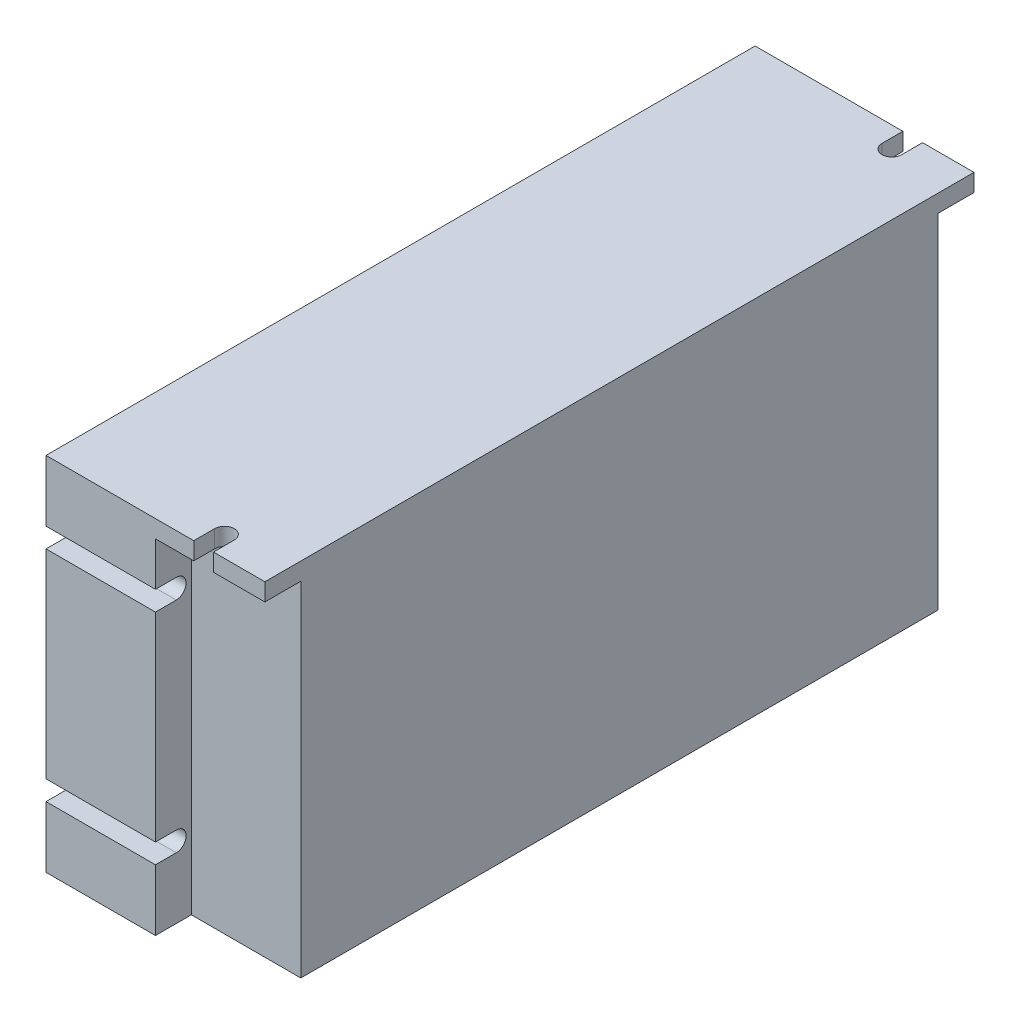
ISO-10303-21;
HEADER;
FILE_DESCRIPTION(('STEP AP214'),'2;1');
FILE_NAME('part.step','',(''),(''),'','','');
FILE_SCHEMA(('AUTOMOTIVE_DESIGN { 1 0 10303 214 1 1 1 1 }'));
ENDSEC;
DATA;
#1=APPLICATION_CONTEXT('core data for automotive mechanical design processes');
#2=APPLICATION_PROTOCOL_DEFINITION('international standard','automotive_design',2000,#1);
#3=PRODUCT_CONTEXT('',#1,'mechanical');
#4=PRODUCT('Part','Part','',(#3));
#5=PRODUCT_RELATED_PRODUCT_CATEGORY('part','',(#4));
#6=PRODUCT_DEFINITION_FORMATION('','',#4);
#7=PRODUCT_DEFINITION_CONTEXT('part definition',#1,'design');
#8=PRODUCT_DEFINITION('design','',#6,#7);
#9=PRODUCT_DEFINITION_SHAPE('','',#8);
#10=(LENGTH_UNIT() NAMED_UNIT(*) SI_UNIT(.MILLI.,.METRE.));
#11=(NAMED_UNIT(*) PLANE_ANGLE_UNIT() SI_UNIT($,.RADIAN.));
#12=(NAMED_UNIT(*) SI_UNIT($,.STERADIAN.) SOLID_ANGLE_UNIT());
#13=UNCERTAINTY_MEASURE_WITH_UNIT(LENGTH_MEASURE(1.E-05),#10,'distance_accuracy_value','');
#14=(GEOMETRIC_REPRESENTATION_CONTEXT(3) GLOBAL_UNCERTAINTY_ASSIGNED_CONTEXT((#13)) GLOBAL_UNIT_ASSIGNED_CONTEXT((#10,
#11,#12)) REPRESENTATION_CONTEXT('',''));
#15=CARTESIAN_POINT('',(0.,0.,0.));
#16=DIRECTION('',(0.,0.,1.));
#17=DIRECTION('',(1.,0.,0.));
#18=AXIS2_PLACEMENT_3D('',#15,#16,#17);
#19=CARTESIAN_POINT('',(50.,-41.25,81.));
#20=DIRECTION('',(0.,0.,-1.));
#21=DIRECTION('',(-1.,0.,0.));
#22=AXIS2_PLACEMENT_3D('',#19,#20,#21);
#23=PLANE('',#22);
#24=DIRECTION('',(-1.,0.,0.));
#25=VECTOR('',#24,1.);
#26=CARTESIAN_POINT('',(50.,41.25,81.));
#27=LINE('',#26,#25);
#28=CARTESIAN_POINT('',(50.,41.25,81.));
#29=VERTEX_POINT('',#28);
#30=CARTESIAN_POINT('',(38.25,41.25,81.));
#31=VERTEX_POINT('',#30);
#32=EDGE_CURVE('E497',#29,#31,#27,.T.);
#33=ORIENTED_EDGE('',*,*,#32,.T.);
#34=DIRECTION('',(0.,1.,0.));
#35=VECTOR('',#34,1.);
#36=CARTESIAN_POINT('',(38.25,37.25,81.));
#37=LINE('',#36,#35);
#38=CARTESIAN_POINT('',(38.25,37.25,81.));
#39=VERTEX_POINT('',#38);
#40=EDGE_CURVE('E287',#39,#31,#37,.T.);
#41=ORIENTED_EDGE('',*,*,#40,.F.);
#42=DIRECTION('',(1.,0.,0.));
#43=VECTOR('',#42,1.);
#44=CARTESIAN_POINT('',(25.,37.25,81.));
#45=LINE('',#44,#43);
#46=CARTESIAN_POINT('',(50.,37.25,81.));
#47=VERTEX_POINT('',#46);
#48=EDGE_CURVE('E463',#39,#47,#45,.T.);
#49=ORIENTED_EDGE('',*,*,#48,.T.);
#50=DIRECTION('',(0.,-1.,0.));
#51=VECTOR('',#50,1.);
#52=CARTESIAN_POINT('',(50.,-41.25,81.));
#53=LINE('',#52,#51);
#54=EDGE_CURVE('E472',#29,#47,#53,.T.);
#55=ORIENTED_EDGE('',*,*,#54,.F.);
#56=EDGE_LOOP('',(#33,#41,#49,#55));
#57=FACE_BOUND('',#56,.T.);
#58=ADVANCED_FACE('F35',(#57),#23,.F.);
#59=CARTESIAN_POINT('',(50.,-41.25,-81.));
#60=DIRECTION('',(0.,0.,1.));
#61=DIRECTION('',(1.,0.,0.));
#62=AXIS2_PLACEMENT_3D('',#59,#60,#61);
#63=PLANE('',#62);
#64=DIRECTION('',(-1.,0.,0.));
#65=VECTOR('',#64,1.);
#66=CARTESIAN_POINT('',(50.,41.25,-81.));
#67=LINE('',#66,#65);
#68=CARTESIAN_POINT('',(33.75,41.25,-81.));
#69=VERTEX_POINT('',#68);
#70=CARTESIAN_POINT('',(0.,41.25,-81.));
#71=VERTEX_POINT('',#70);
#72=EDGE_CURVE('E43',#69,#71,#67,.T.);
#73=ORIENTED_EDGE('',*,*,#72,.F.);
#74=DIRECTION('',(0.,1.,0.));
#75=VECTOR('',#74,1.);
#76=CARTESIAN_POINT('',(33.75,37.25,-81.));
#77=LINE('',#76,#75);
#78=CARTESIAN_POINT('',(33.75,37.25,-81.));
#79=VERTEX_POINT('',#78);
#80=EDGE_CURVE('E309',#79,#69,#77,.T.);
#81=ORIENTED_EDGE('',*,*,#80,.F.);
#82=DIRECTION('',(1.,0.,0.));
#83=VECTOR('',#82,1.);
#84=CARTESIAN_POINT('',(25.,37.25,-81.));
#85=LINE('',#84,#83);
#86=CARTESIAN_POINT('',(25.,37.25,-81.));
#87=VERTEX_POINT('',#86);
#88=EDGE_CURVE('E437',#87,#79,#85,.T.);
#89=ORIENTED_EDGE('',*,*,#88,.F.);
#90=DIRECTION('',(0.,1.,0.));
#91=VECTOR('',#90,1.);
#92=CARTESIAN_POINT('',(25.,-41.25,-81.));
#93=LINE('',#92,#91);
#94=CARTESIAN_POINT('',(25.,27.25,-81.));
#95=VERTEX_POINT('',#94);
#96=EDGE_CURVE('E418',#95,#87,#93,.T.);
#97=ORIENTED_EDGE('',*,*,#96,.F.);
#98=DIRECTION('',(1.,0.,0.));
#99=VECTOR('',#98,1.);
#100=CARTESIAN_POINT('',(0.,27.25,-81.));
#101=LINE('',#100,#99);
#102=CARTESIAN_POINT('',(0.,27.25,-81.));
#103=VERTEX_POINT('',#102);
#104=EDGE_CURVE('E319',#103,#95,#101,.T.);
#105=ORIENTED_EDGE('',*,*,#104,.F.);
#106=DIRECTION('',(0.,1.,0.));
#107=VECTOR('',#106,1.);
#108=CARTESIAN_POINT('',(0.,-41.25,-81.));
#109=LINE('',#108,#107);
#110=EDGE_CURVE('E462',#103,#71,#109,.T.);
#111=ORIENTED_EDGE('',*,*,#110,.T.);
#112=EDGE_LOOP('',(#73,#81,#89,#97,#105,#111));
#113=FACE_BOUND('',#112,.T.);
#114=ADVANCED_FACE('F592',(#113),#63,.F.);
#115=CARTESIAN_POINT('',(0.,0.,0.));
#116=DIRECTION('',(-1.,0.,0.));
#117=DIRECTION('',(0.,0.,1.));
#118=AXIS2_PLACEMENT_3D('',#115,#116,#117);
#119=PLANE('',#118);
#120=CARTESIAN_POINT('',(0.,25.,-76.25));
#121=DIRECTION('',(1.,0.,0.));
#122=DIRECTION('',(0.,0.,-1.));
#123=AXIS2_PLACEMENT_3D('',#120,#121,#122);
#124=CIRCLE('',#123,2.25);
#125=CARTESIAN_POINT('',(0.,27.25,-76.25));
#126=VERTEX_POINT('',#125);
#127=CARTESIAN_POINT('',(0.,22.75,-76.25));
#128=VERTEX_POINT('',#127);
#129=EDGE_CURVE('E334',#126,#128,#124,.T.);
#130=ORIENTED_EDGE('',*,*,#129,.T.);
#131=DIRECTION('',(0.,0.,1.));
#132=VECTOR('',#131,1.);
#133=CARTESIAN_POINT('',(0.,22.75,-81.));
#134=LINE('',#133,#132);
#135=CARTESIAN_POINT('',(0.,22.75,-81.));
#136=VERTEX_POINT('',#135);
#137=EDGE_CURVE('E326',#136,#128,#134,.T.);
#138=ORIENTED_EDGE('',*,*,#137,.F.);
#139=CARTESIAN_POINT('',(0.,-22.75,-81.));
#140=VERTEX_POINT('',#139);
#141=EDGE_CURVE('E483',#140,#136,#109,.T.);
#142=ORIENTED_EDGE('',*,*,#141,.F.);
#143=DIRECTION('',(0.,0.,-1.));
#144=VECTOR('',#143,1.);
#145=CARTESIAN_POINT('',(0.,-22.75,-76.25));
#146=LINE('',#145,#144);
#147=CARTESIAN_POINT('',(0.,-22.75,-76.25));
#148=VERTEX_POINT('',#147);
#149=EDGE_CURVE('E341',#148,#140,#146,.T.);
#150=ORIENTED_EDGE('',*,*,#149,.F.);
#151=CARTESIAN_POINT('',(0.,-25.,-76.25));
#152=DIRECTION('',(1.,0.,0.));
#153=DIRECTION('',(0.,0.,-1.));
#154=AXIS2_PLACEMENT_3D('',#151,#152,#153);
#155=CIRCLE('',#154,2.25);
#156=CARTESIAN_POINT('',(0.,-27.25,-76.25));
#157=VERTEX_POINT('',#156);
#158=EDGE_CURVE('E352',#148,#157,#155,.T.);
#159=ORIENTED_EDGE('',*,*,#158,.T.);
#160=DIRECTION('',(0.,0.,1.));
#161=VECTOR('',#160,1.);
#162=CARTESIAN_POINT('',(0.,-27.25,-81.));
#163=LINE('',#162,#161);
#164=CARTESIAN_POINT('',(0.,-27.25,-81.));
#165=VERTEX_POINT('',#164);
#166=EDGE_CURVE('E359',#165,#157,#163,.T.);
#167=ORIENTED_EDGE('',*,*,#166,.F.);
#168=CARTESIAN_POINT('',(0.,-41.25,-81.));
#169=VERTEX_POINT('',#168);
#170=EDGE_CURVE('E479',#169,#165,#109,.T.);
#171=ORIENTED_EDGE('',*,*,#170,.F.);
#172=DIRECTION('',(0.,0.,-1.));
#173=VECTOR('',#172,1.);
#174=CARTESIAN_POINT('',(0.,-41.25,81.));
#175=LINE('',#174,#173);
#176=CARTESIAN_POINT('',(0.,-41.25,81.));
#177=VERTEX_POINT('',#176);
#178=EDGE_CURVE('E470',#177,#169,#175,.T.);
#179=ORIENTED_EDGE('',*,*,#178,.F.);
#180=DIRECTION('',(0.,-1.,0.));
#181=VECTOR('',#180,1.);
#182=CARTESIAN_POINT('',(0.,-41.25,81.));
#183=LINE('',#182,#181);
#184=CARTESIAN_POINT('',(0.,-27.25,81.));
#185=VERTEX_POINT('',#184);
#186=EDGE_CURVE('E486',#185,#177,#183,.T.);
#187=ORIENTED_EDGE('',*,*,#186,.F.);
#188=DIRECTION('',(0.,0.,1.));
#189=VECTOR('',#188,1.);
#190=CARTESIAN_POINT('',(0.,-27.25,76.25));
#191=LINE('',#190,#189);
#192=CARTESIAN_POINT('',(0.,-27.25,76.25));
#193=VERTEX_POINT('',#192);
#194=EDGE_CURVE('E394',#193,#185,#191,.T.);
#195=ORIENTED_EDGE('',*,*,#194,.F.);
#196=CARTESIAN_POINT('',(0.,-25.,76.25));
#197=DIRECTION('',(1.,0.,0.));
#198=DIRECTION('',(0.,0.,-1.));
#199=AXIS2_PLACEMENT_3D('',#196,#197,#198);
#200=CIRCLE('',#199,2.25);
#201=CARTESIAN_POINT('',(0.,-22.75,76.25));
#202=VERTEX_POINT('',#201);
#203=EDGE_CURVE('E390',#193,#202,#200,.T.);
#204=ORIENTED_EDGE('',*,*,#203,.T.);
#205=DIRECTION('',(0.,0.,-1.));
#206=VECTOR('',#205,1.);
#207=CARTESIAN_POINT('',(0.,-22.75,81.));
#208=LINE('',#207,#206);
#209=CARTESIAN_POINT('',(0.,-22.75,81.));
#210=VERTEX_POINT('',#209);
#211=EDGE_CURVE('E388',#210,#202,#208,.T.);
#212=ORIENTED_EDGE('',*,*,#211,.F.);
#213=CARTESIAN_POINT('',(0.,22.75,81.));
#214=VERTEX_POINT('',#213);
#215=EDGE_CURVE('E490',#214,#210,#183,.T.);
#216=ORIENTED_EDGE('',*,*,#215,.F.);
#217=DIRECTION('',(0.,0.,1.));
#218=VECTOR('',#217,1.);
#219=CARTESIAN_POINT('',(0.,22.75,76.25));
#220=LINE('',#219,#218);
#221=CARTESIAN_POINT('',(0.,22.75,76.25));
#222=VERTEX_POINT('',#221);
#223=EDGE_CURVE('E371',#222,#214,#220,.T.);
#224=ORIENTED_EDGE('',*,*,#223,.F.);
#225=CARTESIAN_POINT('',(0.,25.,76.25));
#226=DIRECTION('',(1.,0.,0.));
#227=DIRECTION('',(0.,0.,-1.));
#228=AXIS2_PLACEMENT_3D('',#225,#226,#227);
#229=CIRCLE('',#228,2.25);
#230=CARTESIAN_POINT('',(0.,27.25,76.25));
#231=VERTEX_POINT('',#230);
#232=EDGE_CURVE('E384',#222,#231,#229,.T.);
#233=ORIENTED_EDGE('',*,*,#232,.T.);
#234=DIRECTION('',(0.,0.,-1.));
#235=VECTOR('',#234,1.);
#236=CARTESIAN_POINT('',(0.,27.25,81.));
#237=LINE('',#236,#235);
#238=CARTESIAN_POINT('',(0.,27.25,81.));
#239=VERTEX_POINT('',#238);
#240=EDGE_CURVE('E376',#239,#231,#237,.T.);
#241=ORIENTED_EDGE('',*,*,#240,.F.);
#242=CARTESIAN_POINT('',(0.,41.25,81.));
#243=VERTEX_POINT('',#242);
#244=EDGE_CURVE('E487',#243,#239,#183,.T.);
#245=ORIENTED_EDGE('',*,*,#244,.F.);
#246=DIRECTION('',(0.,0.,1.));
#247=VECTOR('',#246,1.);
#248=CARTESIAN_POINT('',(0.,41.25,81.));
#249=LINE('',#248,#247);
#250=EDGE_CURVE('E482',#71,#243,#249,.T.);
#251=ORIENTED_EDGE('',*,*,#250,.F.);
#252=ORIENTED_EDGE('',*,*,#110,.F.);
#253=DIRECTION('',(0.,0.,-1.));
#254=VECTOR('',#253,1.);
#255=CARTESIAN_POINT('',(0.,27.25,-76.25));
#256=LINE('',#255,#254);
#257=EDGE_CURVE('E321',#126,#103,#256,.T.);
#258=ORIENTED_EDGE('',*,*,#257,.F.);
#259=EDGE_LOOP('',(#130,#138,#142,#150,#159,#167,#171,#179,#187,#195,#204,#212,#216,#224,#233,
#241,#245,#251,#252,#258));
#260=FACE_BOUND('',#259,.T.);
#261=ADVANCED_FACE('F516',(#260),#119,.T.);
#262=DIRECTION('',(1.,0.,0.));
#263=VECTOR('',#262,1.);
#264=CARTESIAN_POINT('',(0.,22.75,-81.));
#265=LINE('',#264,#263);
#266=CARTESIAN_POINT('',(25.,22.75,-81.));
#267=VERTEX_POINT('',#266);
#268=EDGE_CURVE('E308',#136,#267,#265,.T.);
#269=ORIENTED_EDGE('',*,*,#268,.T.);
#270=CARTESIAN_POINT('',(25.,-22.75,-81.));
#271=VERTEX_POINT('',#270);
#272=EDGE_CURVE('E417',#271,#267,#93,.T.);
#273=ORIENTED_EDGE('',*,*,#272,.F.);
#274=DIRECTION('',(1.,0.,0.));
#275=VECTOR('',#274,1.);
#276=CARTESIAN_POINT('',(0.,-22.75,-81.));
#277=LINE('',#276,#275);
#278=EDGE_CURVE('E345',#140,#271,#277,.T.);
#279=ORIENTED_EDGE('',*,*,#278,.F.);
#280=ORIENTED_EDGE('',*,*,#141,.T.);
#281=EDGE_LOOP('',(#269,#273,#279,#280));
#282=FACE_BOUND('',#281,.T.);
#283=ADVANCED_FACE('F37',(#282),#63,.F.);
#284=CARTESIAN_POINT('',(38.25,37.25,-81.));
#285=VERTEX_POINT('',#284);
#286=CARTESIAN_POINT('',(50.,37.25,-81.));
#287=VERTEX_POINT('',#286);
#288=EDGE_CURVE('E426',#285,#287,#85,.T.);
#289=ORIENTED_EDGE('',*,*,#288,.F.);
#290=DIRECTION('',(0.,1.,0.));
#291=VECTOR('',#290,1.);
#292=CARTESIAN_POINT('',(38.25,37.25,-81.));
#293=LINE('',#292,#291);
#294=CARTESIAN_POINT('',(38.25,41.25,-81.));
#295=VERTEX_POINT('',#294);
#296=EDGE_CURVE('E58',#285,#295,#293,.T.);
#297=ORIENTED_EDGE('',*,*,#296,.T.);
#298=CARTESIAN_POINT('',(50.,41.25,-81.));
#299=VERTEX_POINT('',#298);
#300=EDGE_CURVE('E11',#299,#295,#67,.T.);
#301=ORIENTED_EDGE('',*,*,#300,.F.);
#302=DIRECTION('',(0.,1.,0.));
#303=VECTOR('',#302,1.);
#304=CARTESIAN_POINT('',(50.,-41.25,-81.));
#305=LINE('',#304,#303);
#306=EDGE_CURVE('E467',#287,#299,#305,.T.);
#307=ORIENTED_EDGE('',*,*,#306,.F.);
#308=EDGE_LOOP('',(#289,#297,#301,#307));
#309=FACE_BOUND('',#308,.T.);
#310=ADVANCED_FACE('F547',(#309),#63,.F.);
#311=CARTESIAN_POINT('',(25.,0.,0.));
#312=DIRECTION('',(1.,0.,0.));
#313=DIRECTION('',(0.,0.,-1.));
#314=AXIS2_PLACEMENT_3D('',#311,#312,#313);
#315=PLANE('',#314);
#316=ORIENTED_EDGE('',*,*,#272,.T.);
#317=DIRECTION('',(0.,0.,1.));
#318=VECTOR('',#317,1.);
#319=CARTESIAN_POINT('',(25.,22.75,-81.));
#320=LINE('',#319,#318);
#321=CARTESIAN_POINT('',(25.,22.75,-76.25));
#322=VERTEX_POINT('',#321);
#323=EDGE_CURVE('E329',#267,#322,#320,.T.);
#324=ORIENTED_EDGE('',*,*,#323,.T.);
#325=CARTESIAN_POINT('',(25.,25.,-76.25));
#326=DIRECTION('',(1.,0.,0.));
#327=DIRECTION('',(0.,0.,-1.));
#328=AXIS2_PLACEMENT_3D('',#325,#326,#327);
#329=CIRCLE('',#328,2.25);
#330=CARTESIAN_POINT('',(25.,27.25,-76.25));
#331=VERTEX_POINT('',#330);
#332=EDGE_CURVE('E325',#331,#322,#329,.T.);
#333=ORIENTED_EDGE('',*,*,#332,.F.);
#334=DIRECTION('',(0.,0.,-1.));
#335=VECTOR('',#334,1.);
#336=CARTESIAN_POINT('',(25.,27.25,-76.25));
#337=LINE('',#336,#335);
#338=EDGE_CURVE('E322',#331,#95,#337,.T.);
#339=ORIENTED_EDGE('',*,*,#338,.T.);
#340=ORIENTED_EDGE('',*,*,#96,.T.);
#341=DIRECTION('',(0.,0.,1.));
#342=VECTOR('',#341,1.);
#343=CARTESIAN_POINT('',(25.,37.25,-81.));
#344=LINE('',#343,#342);
#345=CARTESIAN_POINT('',(25.,37.25,-72.8));
#346=VERTEX_POINT('',#345);
#347=EDGE_CURVE('E416',#87,#346,#344,.T.);
#348=ORIENTED_EDGE('',*,*,#347,.T.);
#349=DIRECTION('',(0.,-1.,0.));
#350=VECTOR('',#349,1.);
#351=CARTESIAN_POINT('',(25.,37.25,-72.8));
#352=LINE('',#351,#350);
#353=CARTESIAN_POINT('',(25.,-41.25,-72.8));
#354=VERTEX_POINT('',#353);
#355=EDGE_CURVE('E421',#346,#354,#352,.T.);
#356=ORIENTED_EDGE('',*,*,#355,.T.);
#357=DIRECTION('',(0.,0.,-1.));
#358=VECTOR('',#357,1.);
#359=CARTESIAN_POINT('',(25.,-41.25,-72.8));
#360=LINE('',#359,#358);
#361=CARTESIAN_POINT('',(25.,-41.25,-81.));
#362=VERTEX_POINT('',#361);
#363=EDGE_CURVE('E424',#354,#362,#360,.T.);
#364=ORIENTED_EDGE('',*,*,#363,.T.);
#365=CARTESIAN_POINT('',(25.,-27.25,-81.));
#366=VERTEX_POINT('',#365);
#367=EDGE_CURVE('E413',#362,#366,#93,.T.);
#368=ORIENTED_EDGE('',*,*,#367,.T.);
#369=DIRECTION('',(0.,0.,1.));
#370=VECTOR('',#369,1.);
#371=CARTESIAN_POINT('',(25.,-27.25,-81.));
#372=LINE('',#371,#370);
#373=CARTESIAN_POINT('',(25.,-27.25,-76.25));
#374=VERTEX_POINT('',#373);
#375=EDGE_CURVE('E351',#366,#374,#372,.T.);
#376=ORIENTED_EDGE('',*,*,#375,.T.);
#377=CARTESIAN_POINT('',(25.,-25.,-76.25));
#378=DIRECTION('',(1.,0.,0.));
#379=DIRECTION('',(0.,0.,-1.));
#380=AXIS2_PLACEMENT_3D('',#377,#378,#379);
#381=CIRCLE('',#380,2.25);
#382=CARTESIAN_POINT('',(25.,-22.75,-76.25));
#383=VERTEX_POINT('',#382);
#384=EDGE_CURVE('E355',#383,#374,#381,.T.);
#385=ORIENTED_EDGE('',*,*,#384,.F.);
#386=DIRECTION('',(0.,0.,-1.));
#387=VECTOR('',#386,1.);
#388=CARTESIAN_POINT('',(25.,-22.75,-76.25));
#389=LINE('',#388,#387);
#390=EDGE_CURVE('E348',#383,#271,#389,.T.);
#391=ORIENTED_EDGE('',*,*,#390,.T.);
#392=EDGE_LOOP('',(#316,#324,#333,#339,#340,#348,#356,#364,#368,#376,#385,#391));
#393=FACE_BOUND('',#392,.T.);
#394=ADVANCED_FACE('F563',(#393),#315,.T.);
#395=DIRECTION('',(1.,0.,0.));
#396=VECTOR('',#395,1.);
#397=CARTESIAN_POINT('',(0.,-27.25,-81.));
#398=LINE('',#397,#396);
#399=EDGE_CURVE('E342',#165,#366,#398,.T.);
#400=ORIENTED_EDGE('',*,*,#399,.T.);
#401=ORIENTED_EDGE('',*,*,#367,.F.);
#402=DIRECTION('',(-1.,0.,0.));
#403=VECTOR('',#402,1.);
#404=CARTESIAN_POINT('',(50.,-41.25,-81.));
#405=LINE('',#404,#403);
#406=EDGE_CURVE('E478',#362,#169,#405,.T.);
#407=ORIENTED_EDGE('',*,*,#406,.T.);
#408=ORIENTED_EDGE('',*,*,#170,.T.);
#409=EDGE_LOOP('',(#400,#401,#407,#408));
#410=FACE_BOUND('',#409,.T.);
#411=ADVANCED_FACE('F565',(#410),#63,.F.);
#412=CARTESIAN_POINT('',(25.,37.25,81.));
#413=VERTEX_POINT('',#412);
#414=CARTESIAN_POINT('',(33.75,37.25,81.));
#415=VERTEX_POINT('',#414);
#416=EDGE_CURVE('E460',#413,#415,#45,.T.);
#417=ORIENTED_EDGE('',*,*,#416,.T.);
#418=DIRECTION('',(0.,1.,0.));
#419=VECTOR('',#418,1.);
#420=CARTESIAN_POINT('',(33.75,37.25,81.));
#421=LINE('',#420,#419);
#422=CARTESIAN_POINT('',(33.75,41.25,81.));
#423=VERTEX_POINT('',#422);
#424=EDGE_CURVE('E50',#415,#423,#421,.T.);
#425=ORIENTED_EDGE('',*,*,#424,.T.);
#426=EDGE_CURVE('E496',#423,#243,#27,.T.);
#427=ORIENTED_EDGE('',*,*,#426,.T.);
#428=ORIENTED_EDGE('',*,*,#244,.T.);
#429=DIRECTION('',(1.,0.,0.));
#430=VECTOR('',#429,1.);
#431=CARTESIAN_POINT('',(0.,27.25,81.));
#432=LINE('',#431,#430);
#433=CARTESIAN_POINT('',(25.,27.25,81.));
#434=VERTEX_POINT('',#433);
#435=EDGE_CURVE('E357',#239,#434,#432,.T.);
#436=ORIENTED_EDGE('',*,*,#435,.T.);
#437=DIRECTION('',(0.,-1.,0.));
#438=VECTOR('',#437,1.);
#439=CARTESIAN_POINT('',(25.,-41.25,81.));
#440=LINE('',#439,#438);
#441=EDGE_CURVE('E440',#413,#434,#440,.T.);
#442=ORIENTED_EDGE('',*,*,#441,.F.);
#443=EDGE_LOOP('',(#417,#425,#427,#428,#436,#442));
#444=FACE_BOUND('',#443,.T.);
#445=ADVANCED_FACE('F505',(#444),#23,.F.);
#446=DIRECTION('',(1.,0.,0.));
#447=VECTOR('',#446,1.);
#448=CARTESIAN_POINT('',(0.,22.75,81.));
#449=LINE('',#448,#447);
#450=CARTESIAN_POINT('',(25.,22.75,81.));
#451=VERTEX_POINT('',#450);
#452=EDGE_CURVE('E369',#214,#451,#449,.T.);
#453=ORIENTED_EDGE('',*,*,#452,.F.);
#454=ORIENTED_EDGE('',*,*,#215,.T.);
#455=DIRECTION('',(1.,0.,0.));
#456=VECTOR('',#455,1.);
#457=CARTESIAN_POINT('',(0.,-22.75,81.));
#458=LINE('',#457,#456);
#459=CARTESIAN_POINT('',(25.,-22.75,81.));
#460=VERTEX_POINT('',#459);
#461=EDGE_CURVE('E409',#210,#460,#458,.T.);
#462=ORIENTED_EDGE('',*,*,#461,.T.);
#463=EDGE_CURVE('E444',#451,#460,#440,.T.);
#464=ORIENTED_EDGE('',*,*,#463,.F.);
#465=EDGE_LOOP('',(#453,#454,#462,#464));
#466=FACE_BOUND('',#465,.T.);
#467=ADVANCED_FACE('F611',(#466),#23,.F.);
#468=CARTESIAN_POINT('',(25.,0.,0.));
#469=DIRECTION('',(-1.,0.,0.));
#470=DIRECTION('',(0.,0.,1.));
#471=AXIS2_PLACEMENT_3D('',#468,#469,#470);
#472=PLANE('',#471);
#473=DIRECTION('',(0.,0.,-1.));
#474=VECTOR('',#473,1.);
#475=CARTESIAN_POINT('',(25.,27.25,81.));
#476=LINE('',#475,#474);
#477=CARTESIAN_POINT('',(25.,27.25,76.25));
#478=VERTEX_POINT('',#477);
#479=EDGE_CURVE('E379',#434,#478,#476,.T.);
#480=ORIENTED_EDGE('',*,*,#479,.T.);
#481=CARTESIAN_POINT('',(25.,25.,76.25));
#482=DIRECTION('',(1.,0.,0.));
#483=DIRECTION('',(0.,0.,-1.));
#484=AXIS2_PLACEMENT_3D('',#481,#482,#483);
#485=CIRCLE('',#484,2.25);
#486=CARTESIAN_POINT('',(25.,22.75,76.25));
#487=VERTEX_POINT('',#486);
#488=EDGE_CURVE('E375',#487,#478,#485,.T.);
#489=ORIENTED_EDGE('',*,*,#488,.F.);
#490=DIRECTION('',(0.,0.,1.));
#491=VECTOR('',#490,1.);
#492=CARTESIAN_POINT('',(25.,22.75,76.25));
#493=LINE('',#492,#491);
#494=EDGE_CURVE('E372',#487,#451,#493,.T.);
#495=ORIENTED_EDGE('',*,*,#494,.T.);
#496=ORIENTED_EDGE('',*,*,#463,.T.);
#497=DIRECTION('',(0.,0.,-1.));
#498=VECTOR('',#497,1.);
#499=CARTESIAN_POINT('',(25.,-22.75,81.));
#500=LINE('',#499,#498);
#501=CARTESIAN_POINT('',(25.,-22.75,76.25));
#502=VERTEX_POINT('',#501);
#503=EDGE_CURVE('E382',#460,#502,#500,.T.);
#504=ORIENTED_EDGE('',*,*,#503,.T.);
#505=CARTESIAN_POINT('',(25.,-25.,76.25));
#506=DIRECTION('',(1.,0.,0.));
#507=DIRECTION('',(0.,0.,-1.));
#508=AXIS2_PLACEMENT_3D('',#505,#506,#507);
#509=CIRCLE('',#508,2.25);
#510=CARTESIAN_POINT('',(25.,-27.25,76.25));
#511=VERTEX_POINT('',#510);
#512=EDGE_CURVE('E399',#511,#502,#509,.T.);
#513=ORIENTED_EDGE('',*,*,#512,.F.);
#514=DIRECTION('',(0.,0.,1.));
#515=VECTOR('',#514,1.);
#516=CARTESIAN_POINT('',(25.,-27.25,76.25));
#517=LINE('',#516,#515);
#518=CARTESIAN_POINT('',(25.,-27.25,81.));
#519=VERTEX_POINT('',#518);
#520=EDGE_CURVE('E391',#511,#519,#517,.T.);
#521=ORIENTED_EDGE('',*,*,#520,.T.);
#522=CARTESIAN_POINT('',(25.,-41.25,81.));
#523=VERTEX_POINT('',#522);
#524=EDGE_CURVE('E445',#519,#523,#440,.T.);
#525=ORIENTED_EDGE('',*,*,#524,.T.);
#526=DIRECTION('',(0.,0.,-1.));
#527=VECTOR('',#526,1.);
#528=CARTESIAN_POINT('',(25.,-41.25,72.8));
#529=LINE('',#528,#527);
#530=CARTESIAN_POINT('',(25.,-41.25,72.8));
#531=VERTEX_POINT('',#530);
#532=EDGE_CURVE('E443',#523,#531,#529,.T.);
#533=ORIENTED_EDGE('',*,*,#532,.T.);
#534=DIRECTION('',(0.,1.,0.));
#535=VECTOR('',#534,1.);
#536=CARTESIAN_POINT('',(25.,37.25,72.8));
#537=LINE('',#536,#535);
#538=CARTESIAN_POINT('',(25.,37.25,72.8));
#539=VERTEX_POINT('',#538);
#540=EDGE_CURVE('E448',#531,#539,#537,.T.);
#541=ORIENTED_EDGE('',*,*,#540,.T.);
#542=DIRECTION('',(0.,0.,1.));
#543=VECTOR('',#542,1.);
#544=CARTESIAN_POINT('',(25.,37.25,81.));
#545=LINE('',#544,#543);
#546=EDGE_CURVE('E451',#539,#413,#545,.T.);
#547=ORIENTED_EDGE('',*,*,#546,.T.);
#548=ORIENTED_EDGE('',*,*,#441,.T.);
#549=EDGE_LOOP('',(#480,#489,#495,#496,#504,#513,#521,#525,#533,#541,#547,#548));
#550=FACE_BOUND('',#549,.T.);
#551=ADVANCED_FACE('F527',(#550),#472,.F.);
#552=DIRECTION('',(1.,0.,0.));
#553=VECTOR('',#552,1.);
#554=CARTESIAN_POINT('',(0.,-27.25,81.));
#555=LINE('',#554,#553);
#556=EDGE_CURVE('E396',#185,#519,#555,.T.);
#557=ORIENTED_EDGE('',*,*,#556,.F.);
#558=ORIENTED_EDGE('',*,*,#186,.T.);
#559=DIRECTION('',(-1.,0.,0.));
#560=VECTOR('',#559,1.);
#561=CARTESIAN_POINT('',(50.,-41.25,81.));
#562=LINE('',#561,#560);
#563=EDGE_CURVE('E494',#523,#177,#562,.T.);
#564=ORIENTED_EDGE('',*,*,#563,.F.);
#565=ORIENTED_EDGE('',*,*,#524,.F.);
#566=EDGE_LOOP('',(#557,#558,#564,#565));
#567=FACE_BOUND('',#566,.T.);
#568=ADVANCED_FACE('F618',(#567),#23,.F.);
#569=CARTESIAN_POINT('',(50.,41.25,81.));
#570=DIRECTION('',(0.,-1.,0.));
#571=DIRECTION('',(0.,0.,-1.));
#572=AXIS2_PLACEMENT_3D('',#569,#570,#571);
#573=PLANE('',#572);
#574=CARTESIAN_POINT('',(36.,41.25,76.25));
#575=DIRECTION('',(0.,1.,0.));
#576=DIRECTION('',(0.,0.,1.));
#577=AXIS2_PLACEMENT_3D('',#574,#575,#576);
#578=CIRCLE('',#577,2.25);
#579=CARTESIAN_POINT('',(38.25,41.25,76.25));
#580=VERTEX_POINT('',#579);
#581=CARTESIAN_POINT('',(33.75,41.25,76.25));
#582=VERTEX_POINT('',#581);
#583=EDGE_CURVE('E264',#580,#582,#578,.T.);
#584=ORIENTED_EDGE('',*,*,#583,.F.);
#585=DIRECTION('',(0.,0.,-1.));
#586=VECTOR('',#585,1.);
#587=CARTESIAN_POINT('',(38.25,41.25,81.));
#588=LINE('',#587,#586);
#589=EDGE_CURVE('E275',#31,#580,#588,.T.);
#590=ORIENTED_EDGE('',*,*,#589,.F.);
#591=ORIENTED_EDGE('',*,*,#32,.F.);
#592=DIRECTION('',(0.,0.,1.));
#593=VECTOR('',#592,1.);
#594=CARTESIAN_POINT('',(50.,41.25,81.));
#595=LINE('',#594,#593);
#596=EDGE_CURVE('E469',#299,#29,#595,.T.);
#597=ORIENTED_EDGE('',*,*,#596,.F.);
#598=ORIENTED_EDGE('',*,*,#300,.T.);
#599=DIRECTION('',(0.,0.,-1.));
#600=VECTOR('',#599,1.);
#601=CARTESIAN_POINT('',(38.25,41.25,-81.));
#602=LINE('',#601,#600);
#603=CARTESIAN_POINT('',(38.25,41.25,-76.25));
#604=VERTEX_POINT('',#603);
#605=EDGE_CURVE('E302',#604,#295,#602,.T.);
#606=ORIENTED_EDGE('',*,*,#605,.F.);
#607=CARTESIAN_POINT('',(36.,41.25,-76.25));
#608=DIRECTION('',(0.,1.,0.));
#609=DIRECTION('',(0.,0.,1.));
#610=AXIS2_PLACEMENT_3D('',#607,#608,#609);
#611=CIRCLE('',#610,2.25);
#612=CARTESIAN_POINT('',(33.75,41.25,-76.25));
#613=VERTEX_POINT('',#612);
#614=EDGE_CURVE('E286',#613,#604,#611,.T.);
#615=ORIENTED_EDGE('',*,*,#614,.F.);
#616=DIRECTION('',(0.,0.,1.));
#617=VECTOR('',#616,1.);
#618=CARTESIAN_POINT('',(33.75,41.25,-76.25));
#619=LINE('',#618,#617);
#620=EDGE_CURVE('E294',#69,#613,#619,.T.);
#621=ORIENTED_EDGE('',*,*,#620,.F.);
#622=ORIENTED_EDGE('',*,*,#72,.T.);
#623=ORIENTED_EDGE('',*,*,#250,.T.);
#624=ORIENTED_EDGE('',*,*,#426,.F.);
#625=DIRECTION('',(0.,0.,1.));
#626=VECTOR('',#625,1.);
#627=CARTESIAN_POINT('',(33.75,41.25,76.25));
#628=LINE('',#627,#626);
#629=EDGE_CURVE('E278',#582,#423,#628,.T.);
#630=ORIENTED_EDGE('',*,*,#629,.F.);
#631=EDGE_LOOP('',(#584,#590,#591,#597,#598,#606,#615,#621,#622,#623,#624,#630));
#632=FACE_BOUND('',#631,.T.);
#633=ADVANCED_FACE('F509',(#632),#573,.F.);
#634=CARTESIAN_POINT('',(50.,-41.25,81.));
#635=DIRECTION('',(0.,1.,0.));
#636=DIRECTION('',(0.,0.,1.));
#637=AXIS2_PLACEMENT_3D('',#634,#635,#636);
#638=PLANE('',#637);
#639=ORIENTED_EDGE('',*,*,#363,.F.);
#640=DIRECTION('',(1.,0.,0.));
#641=VECTOR('',#640,1.);
#642=CARTESIAN_POINT('',(25.,-41.25,-72.8));
#643=LINE('',#642,#641);
#644=CARTESIAN_POINT('',(50.,-41.25,-72.8));
#645=VERTEX_POINT('',#644);
#646=EDGE_CURVE('E431',#354,#645,#643,.T.);
#647=ORIENTED_EDGE('',*,*,#646,.T.);
#648=DIRECTION('',(0.,0.,-1.));
#649=VECTOR('',#648,1.);
#650=CARTESIAN_POINT('',(50.,-41.25,81.));
#651=LINE('',#650,#649);
#652=CARTESIAN_POINT('',(50.,-41.25,72.8));
#653=VERTEX_POINT('',#652);
#654=EDGE_CURVE('E475',#653,#645,#651,.T.);
#655=ORIENTED_EDGE('',*,*,#654,.F.);
#656=DIRECTION('',(1.,0.,0.));
#657=VECTOR('',#656,1.);
#658=CARTESIAN_POINT('',(25.,-41.25,72.8));
#659=LINE('',#658,#657);
#660=EDGE_CURVE('E454',#531,#653,#659,.T.);
#661=ORIENTED_EDGE('',*,*,#660,.F.);
#662=ORIENTED_EDGE('',*,*,#532,.F.);
#663=ORIENTED_EDGE('',*,*,#563,.T.);
#664=ORIENTED_EDGE('',*,*,#178,.T.);
#665=ORIENTED_EDGE('',*,*,#406,.F.);
#666=EDGE_LOOP('',(#639,#647,#655,#661,#662,#663,#664,#665));
#667=FACE_BOUND('',#666,.T.);
#668=ADVANCED_FACE('F558',(#667),#638,.F.);
#669=CARTESIAN_POINT('',(50.,0.,0.));
#670=DIRECTION('',(-1.,0.,0.));
#671=DIRECTION('',(0.,0.,1.));
#672=AXIS2_PLACEMENT_3D('',#669,#670,#671);
#673=PLANE('',#672);
#674=ORIENTED_EDGE('',*,*,#654,.T.);
#675=DIRECTION('',(0.,-1.,0.));
#676=VECTOR('',#675,1.);
#677=CARTESIAN_POINT('',(50.,37.25,-72.8));
#678=LINE('',#677,#676);
#679=CARTESIAN_POINT('',(50.,37.25,-72.8));
#680=VERTEX_POINT('',#679);
#681=EDGE_CURVE('E429',#680,#645,#678,.T.);
#682=ORIENTED_EDGE('',*,*,#681,.F.);
#683=DIRECTION('',(0.,0.,1.));
#684=VECTOR('',#683,1.);
#685=CARTESIAN_POINT('',(50.,37.25,-81.));
#686=LINE('',#685,#684);
#687=EDGE_CURVE('E412',#287,#680,#686,.T.);
#688=ORIENTED_EDGE('',*,*,#687,.F.);
#689=ORIENTED_EDGE('',*,*,#306,.T.);
#690=ORIENTED_EDGE('',*,*,#596,.T.);
#691=ORIENTED_EDGE('',*,*,#54,.T.);
#692=DIRECTION('',(0.,0.,1.));
#693=VECTOR('',#692,1.);
#694=CARTESIAN_POINT('',(50.,37.25,81.));
#695=LINE('',#694,#693);
#696=CARTESIAN_POINT('',(50.,37.25,72.8));
#697=VERTEX_POINT('',#696);
#698=EDGE_CURVE('E457',#697,#47,#695,.T.);
#699=ORIENTED_EDGE('',*,*,#698,.F.);
#700=DIRECTION('',(0.,1.,0.));
#701=VECTOR('',#700,1.);
#702=CARTESIAN_POINT('',(50.,37.25,72.8));
#703=LINE('',#702,#701);
#704=EDGE_CURVE('E434',#653,#697,#703,.T.);
#705=ORIENTED_EDGE('',*,*,#704,.F.);
#706=EDGE_LOOP('',(#674,#682,#688,#689,#690,#691,#699,#705));
#707=FACE_BOUND('',#706,.T.);
#708=ADVANCED_FACE('F537',(#707),#673,.F.);
#709=CARTESIAN_POINT('',(25.,37.25,81.));
#710=DIRECTION('',(0.,1.,0.));
#711=DIRECTION('',(0.,0.,1.));
#712=AXIS2_PLACEMENT_3D('',#709,#710,#711);
#713=PLANE('',#712);
#714=ORIENTED_EDGE('',*,*,#48,.F.);
#715=DIRECTION('',(0.,0.,-1.));
#716=VECTOR('',#715,1.);
#717=CARTESIAN_POINT('',(38.25,37.25,81.));
#718=LINE('',#717,#716);
#719=CARTESIAN_POINT('',(38.25,37.25,76.25));
#720=VERTEX_POINT('',#719);
#721=EDGE_CURVE('E266',#39,#720,#718,.T.);
#722=ORIENTED_EDGE('',*,*,#721,.T.);
#723=CARTESIAN_POINT('',(36.,37.25,76.25));
#724=DIRECTION('',(0.,1.,0.));
#725=DIRECTION('',(0.,0.,1.));
#726=AXIS2_PLACEMENT_3D('',#723,#724,#725);
#727=CIRCLE('',#726,2.25);
#728=CARTESIAN_POINT('',(33.75,37.25,76.25));
#729=VERTEX_POINT('',#728);
#730=EDGE_CURVE('E261',#720,#729,#727,.T.);
#731=ORIENTED_EDGE('',*,*,#730,.T.);
#732=DIRECTION('',(0.,0.,1.));
#733=VECTOR('',#732,1.);
#734=CARTESIAN_POINT('',(33.75,37.25,76.25));
#735=LINE('',#734,#733);
#736=EDGE_CURVE('E268',#729,#415,#735,.T.);
#737=ORIENTED_EDGE('',*,*,#736,.T.);
#738=ORIENTED_EDGE('',*,*,#416,.F.);
#739=ORIENTED_EDGE('',*,*,#546,.F.);
#740=DIRECTION('',(1.,0.,0.));
#741=VECTOR('',#740,1.);
#742=CARTESIAN_POINT('',(25.,37.25,72.8));
#743=LINE('',#742,#741);
#744=EDGE_CURVE('E464',#539,#697,#743,.T.);
#745=ORIENTED_EDGE('',*,*,#744,.T.);
#746=ORIENTED_EDGE('',*,*,#698,.T.);
#747=EDGE_LOOP('',(#714,#722,#731,#737,#738,#739,#745,#746));
#748=FACE_BOUND('',#747,.T.);
#749=ADVANCED_FACE('F274',(#748),#713,.F.);
#750=CARTESIAN_POINT('',(25.,37.25,72.8));
#751=DIRECTION('',(0.,0.,-1.));
#752=DIRECTION('',(-1.,0.,0.));
#753=AXIS2_PLACEMENT_3D('',#750,#751,#752);
#754=PLANE('',#753);
#755=ORIENTED_EDGE('',*,*,#704,.T.);
#756=ORIENTED_EDGE('',*,*,#744,.F.);
#757=ORIENTED_EDGE('',*,*,#540,.F.);
#758=ORIENTED_EDGE('',*,*,#660,.T.);
#759=EDGE_LOOP('',(#755,#756,#757,#758));
#760=FACE_BOUND('',#759,.T.);
#761=ADVANCED_FACE('F533',(#760),#754,.F.);
#762=CARTESIAN_POINT('',(25.,37.25,-72.8));
#763=DIRECTION('',(0.,0.,1.));
#764=DIRECTION('',(1.,0.,0.));
#765=AXIS2_PLACEMENT_3D('',#762,#763,#764);
#766=PLANE('',#765);
#767=ORIENTED_EDGE('',*,*,#681,.T.);
#768=ORIENTED_EDGE('',*,*,#646,.F.);
#769=ORIENTED_EDGE('',*,*,#355,.F.);
#770=DIRECTION('',(1.,0.,0.));
#771=VECTOR('',#770,1.);
#772=CARTESIAN_POINT('',(25.,37.25,-72.8));
#773=LINE('',#772,#771);
#774=EDGE_CURVE('E435',#346,#680,#773,.T.);
#775=ORIENTED_EDGE('',*,*,#774,.T.);
#776=EDGE_LOOP('',(#767,#768,#769,#775));
#777=FACE_BOUND('',#776,.T.);
#778=ADVANCED_FACE('F554',(#777),#766,.F.);
#779=CARTESIAN_POINT('',(25.,37.25,-81.));
#780=DIRECTION('',(0.,1.,0.));
#781=DIRECTION('',(0.,0.,1.));
#782=AXIS2_PLACEMENT_3D('',#779,#780,#781);
#783=PLANE('',#782);
#784=ORIENTED_EDGE('',*,*,#88,.T.);
#785=DIRECTION('',(0.,0.,1.));
#786=VECTOR('',#785,1.);
#787=CARTESIAN_POINT('',(33.75,37.25,-76.25));
#788=LINE('',#787,#786);
#789=CARTESIAN_POINT('',(33.75,37.25,-76.25));
#790=VERTEX_POINT('',#789);
#791=EDGE_CURVE('E296',#79,#790,#788,.T.);
#792=ORIENTED_EDGE('',*,*,#791,.T.);
#793=CARTESIAN_POINT('',(36.,37.25,-76.25));
#794=DIRECTION('',(0.,1.,0.));
#795=DIRECTION('',(0.,0.,1.));
#796=AXIS2_PLACEMENT_3D('',#793,#794,#795);
#797=CIRCLE('',#796,2.25);
#798=CARTESIAN_POINT('',(38.25,37.25,-76.25));
#799=VERTEX_POINT('',#798);
#800=EDGE_CURVE('E290',#790,#799,#797,.T.);
#801=ORIENTED_EDGE('',*,*,#800,.T.);
#802=DIRECTION('',(0.,0.,-1.));
#803=VECTOR('',#802,1.);
#804=CARTESIAN_POINT('',(38.25,37.25,-81.));
#805=LINE('',#804,#803);
#806=EDGE_CURVE('E293',#799,#285,#805,.T.);
#807=ORIENTED_EDGE('',*,*,#806,.T.);
#808=ORIENTED_EDGE('',*,*,#288,.T.);
#809=ORIENTED_EDGE('',*,*,#687,.T.);
#810=ORIENTED_EDGE('',*,*,#774,.F.);
#811=ORIENTED_EDGE('',*,*,#347,.F.);
#812=EDGE_LOOP('',(#784,#792,#801,#807,#808,#809,#810,#811));
#813=FACE_BOUND('',#812,.T.);
#814=ADVANCED_FACE('F550',(#813),#783,.F.);
#815=CARTESIAN_POINT('',(0.,-22.75,81.));
#816=DIRECTION('',(0.,-1.,0.));
#817=DIRECTION('',(0.,0.,-1.));
#818=AXIS2_PLACEMENT_3D('',#815,#816,#817);
#819=PLANE('',#818);
#820=ORIENTED_EDGE('',*,*,#503,.F.);
#821=ORIENTED_EDGE('',*,*,#461,.F.);
#822=ORIENTED_EDGE('',*,*,#211,.T.);
#823=DIRECTION('',(1.,0.,0.));
#824=VECTOR('',#823,1.);
#825=CARTESIAN_POINT('',(0.,-22.75,76.25));
#826=LINE('',#825,#824);
#827=EDGE_CURVE('E407',#202,#502,#826,.T.);
#828=ORIENTED_EDGE('',*,*,#827,.T.);
#829=EDGE_LOOP('',(#820,#821,#822,#828));
#830=FACE_BOUND('',#829,.T.);
#831=ADVANCED_FACE('F644',(#830),#819,.T.);
#832=CARTESIAN_POINT('',(0.,-25.,76.25));
#833=DIRECTION('',(1.,0.,0.));
#834=DIRECTION('',(0.,0.,-1.));
#835=AXIS2_PLACEMENT_3D('',#832,#833,#834);
#836=CYLINDRICAL_SURFACE('',#835,2.25);
#837=ORIENTED_EDGE('',*,*,#512,.T.);
#838=ORIENTED_EDGE('',*,*,#827,.F.);
#839=ORIENTED_EDGE('',*,*,#203,.F.);
#840=DIRECTION('',(1.,0.,0.));
#841=VECTOR('',#840,1.);
#842=CARTESIAN_POINT('',(0.,-27.25,76.25));
#843=LINE('',#842,#841);
#844=EDGE_CURVE('E405',#193,#511,#843,.T.);
#845=ORIENTED_EDGE('',*,*,#844,.T.);
#846=EDGE_LOOP('',(#837,#838,#839,#845));
#847=FACE_BOUND('',#846,.T.);
#848=ADVANCED_FACE('F648',(#847),#836,.F.);
#849=CARTESIAN_POINT('',(0.,-27.25,76.25));
#850=DIRECTION('',(0.,1.,0.));
#851=DIRECTION('',(0.,0.,1.));
#852=AXIS2_PLACEMENT_3D('',#849,#850,#851);
#853=PLANE('',#852);
#854=ORIENTED_EDGE('',*,*,#520,.F.);
#855=ORIENTED_EDGE('',*,*,#844,.F.);
#856=ORIENTED_EDGE('',*,*,#194,.T.);
#857=ORIENTED_EDGE('',*,*,#556,.T.);
#858=EDGE_LOOP('',(#854,#855,#856,#857));
#859=FACE_BOUND('',#858,.T.);
#860=ADVANCED_FACE('F650',(#859),#853,.T.);
#861=CARTESIAN_POINT('',(0.,27.25,81.));
#862=DIRECTION('',(0.,-1.,0.));
#863=DIRECTION('',(0.,0.,-1.));
#864=AXIS2_PLACEMENT_3D('',#861,#862,#863);
#865=PLANE('',#864);
#866=ORIENTED_EDGE('',*,*,#479,.F.);
#867=ORIENTED_EDGE('',*,*,#435,.F.);
#868=ORIENTED_EDGE('',*,*,#240,.T.);
#869=DIRECTION('',(1.,0.,0.));
#870=VECTOR('',#869,1.);
#871=CARTESIAN_POINT('',(0.,27.25,76.25));
#872=LINE('',#871,#870);
#873=EDGE_CURVE('E365',#231,#478,#872,.T.);
#874=ORIENTED_EDGE('',*,*,#873,.T.);
#875=EDGE_LOOP('',(#866,#867,#868,#874));
#876=FACE_BOUND('',#875,.T.);
#877=ADVANCED_FACE('F521',(#876),#865,.T.);
#878=CARTESIAN_POINT('',(0.,25.,76.25));
#879=DIRECTION('',(1.,0.,0.));
#880=DIRECTION('',(0.,0.,-1.));
#881=AXIS2_PLACEMENT_3D('',#878,#879,#880);
#882=CYLINDRICAL_SURFACE('',#881,2.25);
#883=ORIENTED_EDGE('',*,*,#488,.T.);
#884=ORIENTED_EDGE('',*,*,#873,.F.);
#885=ORIENTED_EDGE('',*,*,#232,.F.);
#886=DIRECTION('',(1.,0.,0.));
#887=VECTOR('',#886,1.);
#888=CARTESIAN_POINT('',(0.,22.75,76.25));
#889=LINE('',#888,#887);
#890=EDGE_CURVE('E367',#222,#487,#889,.T.);
#891=ORIENTED_EDGE('',*,*,#890,.T.);
#892=EDGE_LOOP('',(#883,#884,#885,#891));
#893=FACE_BOUND('',#892,.T.);
#894=ADVANCED_FACE('F523',(#893),#882,.F.);
#895=CARTESIAN_POINT('',(0.,22.75,76.25));
#896=DIRECTION('',(0.,1.,0.));
#897=DIRECTION('',(0.,0.,1.));
#898=AXIS2_PLACEMENT_3D('',#895,#896,#897);
#899=PLANE('',#898);
#900=ORIENTED_EDGE('',*,*,#494,.F.);
#901=ORIENTED_EDGE('',*,*,#890,.F.);
#902=ORIENTED_EDGE('',*,*,#223,.T.);
#903=ORIENTED_EDGE('',*,*,#452,.T.);
#904=EDGE_LOOP('',(#900,#901,#902,#903));
#905=FACE_BOUND('',#904,.T.);
#906=ADVANCED_FACE('F660',(#905),#899,.T.);
#907=CARTESIAN_POINT('',(0.,-25.,-76.25));
#908=DIRECTION('',(1.,0.,0.));
#909=DIRECTION('',(0.,0.,-1.));
#910=AXIS2_PLACEMENT_3D('',#907,#908,#909);
#911=CYLINDRICAL_SURFACE('',#910,2.25);
#912=ORIENTED_EDGE('',*,*,#384,.T.);
#913=DIRECTION('',(1.,0.,0.));
#914=VECTOR('',#913,1.);
#915=CARTESIAN_POINT('',(0.,-27.25,-76.25));
#916=LINE('',#915,#914);
#917=EDGE_CURVE('E338',#157,#374,#916,.T.);
#918=ORIENTED_EDGE('',*,*,#917,.F.);
#919=ORIENTED_EDGE('',*,*,#158,.F.);
#920=DIRECTION('',(1.,0.,0.));
#921=VECTOR('',#920,1.);
#922=CARTESIAN_POINT('',(0.,-22.75,-76.25));
#923=LINE('',#922,#921);
#924=EDGE_CURVE('E332',#148,#383,#923,.T.);
#925=ORIENTED_EDGE('',*,*,#924,.T.);
#926=EDGE_LOOP('',(#912,#918,#919,#925));
#927=FACE_BOUND('',#926,.T.);
#928=ADVANCED_FACE('F576',(#927),#911,.F.);
#929=CARTESIAN_POINT('',(0.,-22.75,-76.25));
#930=DIRECTION('',(0.,-1.,0.));
#931=DIRECTION('',(0.,0.,-1.));
#932=AXIS2_PLACEMENT_3D('',#929,#930,#931);
#933=PLANE('',#932);
#934=ORIENTED_EDGE('',*,*,#390,.F.);
#935=ORIENTED_EDGE('',*,*,#924,.F.);
#936=ORIENTED_EDGE('',*,*,#149,.T.);
#937=ORIENTED_EDGE('',*,*,#278,.T.);
#938=EDGE_LOOP('',(#934,#935,#936,#937));
#939=FACE_BOUND('',#938,.T.);
#940=ADVANCED_FACE('F747',(#939),#933,.T.);
#941=CARTESIAN_POINT('',(0.,-27.25,-81.));
#942=DIRECTION('',(0.,1.,0.));
#943=DIRECTION('',(0.,0.,1.));
#944=AXIS2_PLACEMENT_3D('',#941,#942,#943);
#945=PLANE('',#944);
#946=ORIENTED_EDGE('',*,*,#375,.F.);
#947=ORIENTED_EDGE('',*,*,#399,.F.);
#948=ORIENTED_EDGE('',*,*,#166,.T.);
#949=ORIENTED_EDGE('',*,*,#917,.T.);
#950=EDGE_LOOP('',(#946,#947,#948,#949));
#951=FACE_BOUND('',#950,.T.);
#952=ADVANCED_FACE('F569',(#951),#945,.T.);
#953=CARTESIAN_POINT('',(0.,22.75,-81.));
#954=DIRECTION('',(0.,1.,0.));
#955=DIRECTION('',(0.,0.,1.));
#956=AXIS2_PLACEMENT_3D('',#953,#954,#955);
#957=PLANE('',#956);
#958=ORIENTED_EDGE('',*,*,#323,.F.);
#959=ORIENTED_EDGE('',*,*,#268,.F.);
#960=ORIENTED_EDGE('',*,*,#137,.T.);
#961=DIRECTION('',(1.,0.,0.));
#962=VECTOR('',#961,1.);
#963=CARTESIAN_POINT('',(0.,22.75,-76.25));
#964=LINE('',#963,#962);
#965=EDGE_CURVE('E315',#128,#322,#964,.T.);
#966=ORIENTED_EDGE('',*,*,#965,.T.);
#967=EDGE_LOOP('',(#958,#959,#960,#966));
#968=FACE_BOUND('',#967,.T.);
#969=ADVANCED_FACE('F764',(#968),#957,.T.);
#970=CARTESIAN_POINT('',(0.,25.,-76.25));
#971=DIRECTION('',(1.,0.,0.));
#972=DIRECTION('',(0.,0.,-1.));
#973=AXIS2_PLACEMENT_3D('',#970,#971,#972);
#974=CYLINDRICAL_SURFACE('',#973,2.25);
#975=ORIENTED_EDGE('',*,*,#332,.T.);
#976=ORIENTED_EDGE('',*,*,#965,.F.);
#977=ORIENTED_EDGE('',*,*,#129,.F.);
#978=DIRECTION('',(1.,0.,0.));
#979=VECTOR('',#978,1.);
#980=CARTESIAN_POINT('',(0.,27.25,-76.25));
#981=LINE('',#980,#979);
#982=EDGE_CURVE('E317',#126,#331,#981,.T.);
#983=ORIENTED_EDGE('',*,*,#982,.T.);
#984=EDGE_LOOP('',(#975,#976,#977,#983));
#985=FACE_BOUND('',#984,.T.);
#986=ADVANCED_FACE('F773',(#985),#974,.F.);
#987=CARTESIAN_POINT('',(0.,27.25,-76.25));
#988=DIRECTION('',(0.,-1.,0.));
#989=DIRECTION('',(0.,0.,-1.));
#990=AXIS2_PLACEMENT_3D('',#987,#988,#989);
#991=PLANE('',#990);
#992=ORIENTED_EDGE('',*,*,#338,.F.);
#993=ORIENTED_EDGE('',*,*,#982,.F.);
#994=ORIENTED_EDGE('',*,*,#257,.T.);
#995=ORIENTED_EDGE('',*,*,#104,.T.);
#996=EDGE_LOOP('',(#992,#993,#994,#995));
#997=FACE_BOUND('',#996,.T.);
#998=ADVANCED_FACE('F783',(#997),#991,.T.);
#999=CARTESIAN_POINT('',(36.,37.25,-76.25));
#1000=DIRECTION('',(0.,1.,0.));
#1001=DIRECTION('',(0.,0.,1.));
#1002=AXIS2_PLACEMENT_3D('',#999,#1000,#1001);
#1003=CYLINDRICAL_SURFACE('',#1002,2.25);
#1004=ORIENTED_EDGE('',*,*,#614,.T.);
#1005=DIRECTION('',(0.,1.,0.));
#1006=VECTOR('',#1005,1.);
#1007=CARTESIAN_POINT('',(38.25,37.25,-76.25));
#1008=LINE('',#1007,#1006);
#1009=EDGE_CURVE('E299',#799,#604,#1008,.T.);
#1010=ORIENTED_EDGE('',*,*,#1009,.F.);
#1011=ORIENTED_EDGE('',*,*,#800,.F.);
#1012=DIRECTION('',(0.,1.,0.));
#1013=VECTOR('',#1012,1.);
#1014=CARTESIAN_POINT('',(33.75,37.25,-76.25));
#1015=LINE('',#1014,#1013);
#1016=EDGE_CURVE('E306',#790,#613,#1015,.T.);
#1017=ORIENTED_EDGE('',*,*,#1016,.T.);
#1018=EDGE_LOOP('',(#1004,#1010,#1011,#1017));
#1019=FACE_BOUND('',#1018,.T.);
#1020=ADVANCED_FACE('F597',(#1019),#1003,.F.);
#1021=CARTESIAN_POINT('',(33.75,37.25,-76.25));
#1022=DIRECTION('',(-1.,0.,0.));
#1023=DIRECTION('',(0.,0.,1.));
#1024=AXIS2_PLACEMENT_3D('',#1021,#1022,#1023);
#1025=PLANE('',#1024);
#1026=ORIENTED_EDGE('',*,*,#620,.T.);
#1027=ORIENTED_EDGE('',*,*,#1016,.F.);
#1028=ORIENTED_EDGE('',*,*,#791,.F.);
#1029=ORIENTED_EDGE('',*,*,#80,.T.);
#1030=EDGE_LOOP('',(#1026,#1027,#1028,#1029));
#1031=FACE_BOUND('',#1030,.T.);
#1032=ADVANCED_FACE('F594',(#1031),#1025,.F.);
#1033=CARTESIAN_POINT('',(38.25,37.25,-81.));
#1034=DIRECTION('',(1.,0.,0.));
#1035=DIRECTION('',(0.,0.,-1.));
#1036=AXIS2_PLACEMENT_3D('',#1033,#1034,#1035);
#1037=PLANE('',#1036);
#1038=ORIENTED_EDGE('',*,*,#605,.T.);
#1039=ORIENTED_EDGE('',*,*,#296,.F.);
#1040=ORIENTED_EDGE('',*,*,#806,.F.);
#1041=ORIENTED_EDGE('',*,*,#1009,.T.);
#1042=EDGE_LOOP('',(#1038,#1039,#1040,#1041));
#1043=FACE_BOUND('',#1042,.T.);
#1044=ADVANCED_FACE('F599',(#1043),#1037,.F.);
#1045=CARTESIAN_POINT('',(36.,37.25,76.25));
#1046=DIRECTION('',(0.,1.,0.));
#1047=DIRECTION('',(0.,0.,1.));
#1048=AXIS2_PLACEMENT_3D('',#1045,#1046,#1047);
#1049=CYLINDRICAL_SURFACE('',#1048,2.25);
#1050=ORIENTED_EDGE('',*,*,#583,.T.);
#1051=DIRECTION('',(0.,1.,0.));
#1052=VECTOR('',#1051,1.);
#1053=CARTESIAN_POINT('',(33.75,37.25,76.25));
#1054=LINE('',#1053,#1052);
#1055=EDGE_CURVE('E258',#729,#582,#1054,.T.);
#1056=ORIENTED_EDGE('',*,*,#1055,.F.);
#1057=ORIENTED_EDGE('',*,*,#730,.F.);
#1058=DIRECTION('',(0.,1.,0.));
#1059=VECTOR('',#1058,1.);
#1060=CARTESIAN_POINT('',(38.25,37.25,76.25));
#1061=LINE('',#1060,#1059);
#1062=EDGE_CURVE('E284',#720,#580,#1061,.T.);
#1063=ORIENTED_EDGE('',*,*,#1062,.T.);
#1064=EDGE_LOOP('',(#1050,#1056,#1057,#1063));
#1065=FACE_BOUND('',#1064,.T.);
#1066=ADVANCED_FACE('F259',(#1065),#1049,.F.);
#1067=CARTESIAN_POINT('',(38.25,37.25,81.));
#1068=DIRECTION('',(1.,0.,0.));
#1069=DIRECTION('',(0.,0.,-1.));
#1070=AXIS2_PLACEMENT_3D('',#1067,#1068,#1069);
#1071=PLANE('',#1070);
#1072=ORIENTED_EDGE('',*,*,#589,.T.);
#1073=ORIENTED_EDGE('',*,*,#1062,.F.);
#1074=ORIENTED_EDGE('',*,*,#721,.F.);
#1075=ORIENTED_EDGE('',*,*,#40,.T.);
#1076=EDGE_LOOP('',(#1072,#1073,#1074,#1075));
#1077=FACE_BOUND('',#1076,.T.);
#1078=ADVANCED_FACE('F541',(#1077),#1071,.F.);
#1079=CARTESIAN_POINT('',(33.75,37.25,76.25));
#1080=DIRECTION('',(-1.,0.,0.));
#1081=DIRECTION('',(0.,0.,1.));
#1082=AXIS2_PLACEMENT_3D('',#1079,#1080,#1081);
#1083=PLANE('',#1082);
#1084=ORIENTED_EDGE('',*,*,#629,.T.);
#1085=ORIENTED_EDGE('',*,*,#424,.F.);
#1086=ORIENTED_EDGE('',*,*,#736,.F.);
#1087=ORIENTED_EDGE('',*,*,#1055,.T.);
#1088=EDGE_LOOP('',(#1084,#1085,#1086,#1087));
#1089=FACE_BOUND('',#1088,.T.);
#1090=ADVANCED_FACE('F269',(#1089),#1083,.F.);
#1091=CLOSED_SHELL('',(#58,#114,#261,#283,#310,#394,#411,#445,#467,#551,#568,#633,#668,#708,
#749,#761,#778,#814,#831,#848,#860,#877,#894,#906,#928,#940,#952,#969,#986,#998,#1020,#1032,
#1044,#1066,#1078,#1090));
#1092=MANIFOLD_SOLID_BREP('B2',#1091);
#1093=ADVANCED_BREP_SHAPE_REPRESENTATION('',(#18,#1092),#14);
#1094=SHAPE_DEFINITION_REPRESENTATION(#9,#1093);
ENDSEC;
END-ISO-10303-21;
